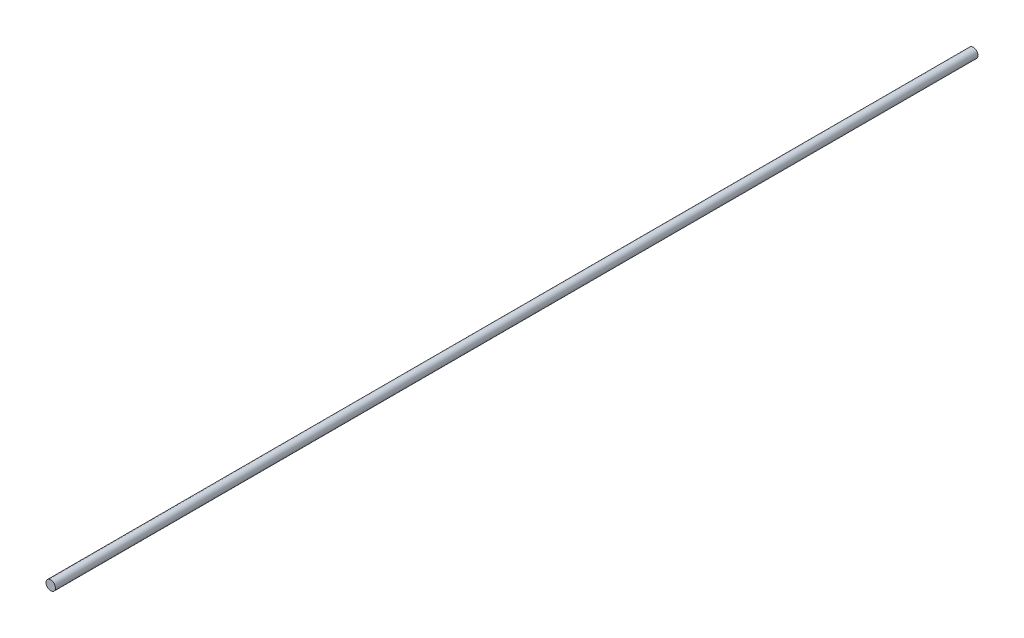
ISO-10303-21;
HEADER;
FILE_DESCRIPTION(('STEP AP214'),'2;1');
FILE_NAME('part.step','',(''),(''),'','','');
FILE_SCHEMA(('AUTOMOTIVE_DESIGN { 1 0 10303 214 1 1 1 1 }'));
ENDSEC;
DATA;
#1=APPLICATION_CONTEXT('core data for automotive mechanical design processes');
#2=APPLICATION_PROTOCOL_DEFINITION('international standard','automotive_design',2000,#1);
#3=PRODUCT_CONTEXT('',#1,'mechanical');
#4=PRODUCT('Part','Part','',(#3));
#5=PRODUCT_RELATED_PRODUCT_CATEGORY('part','',(#4));
#6=PRODUCT_DEFINITION_FORMATION('','',#4);
#7=PRODUCT_DEFINITION_CONTEXT('part definition',#1,'design');
#8=PRODUCT_DEFINITION('design','',#6,#7);
#9=PRODUCT_DEFINITION_SHAPE('','',#8);
#10=(LENGTH_UNIT() NAMED_UNIT(*) SI_UNIT(.MILLI.,.METRE.));
#11=(NAMED_UNIT(*) PLANE_ANGLE_UNIT() SI_UNIT($,.RADIAN.));
#12=(NAMED_UNIT(*) SI_UNIT($,.STERADIAN.) SOLID_ANGLE_UNIT());
#13=UNCERTAINTY_MEASURE_WITH_UNIT(LENGTH_MEASURE(1.E-05),#10,'distance_accuracy_value','');
#14=(GEOMETRIC_REPRESENTATION_CONTEXT(3) GLOBAL_UNCERTAINTY_ASSIGNED_CONTEXT((#13)) GLOBAL_UNIT_ASSIGNED_CONTEXT((#10,
#11,#12)) REPRESENTATION_CONTEXT('',''));
#15=CARTESIAN_POINT('',(0.,0.,0.));
#16=DIRECTION('',(0.,0.,1.));
#17=DIRECTION('',(1.,0.,0.));
#18=AXIS2_PLACEMENT_3D('',#15,#16,#17);
#19=CARTESIAN_POINT('',(0.,0.,-5850.));
#20=DIRECTION('',(0.,0.,1.));
#21=DIRECTION('',(1.,0.,0.));
#22=AXIS2_PLACEMENT_3D('',#19,#20,#21);
#23=CYLINDRICAL_SURFACE('',#22,30.);
#24=CARTESIAN_POINT('',(0.,0.,-5850.));
#25=DIRECTION('',(0.,0.,1.));
#26=DIRECTION('',(1.,0.,0.));
#27=AXIS2_PLACEMENT_3D('',#24,#25,#26);
#28=CIRCLE('',#27,30.);
#29=CARTESIAN_POINT('',(30.,0.,-5850.));
#30=VERTEX_POINT('',#29);
#31=EDGE_CURVE('E10',#30,#30,#28,.T.);
#32=ORIENTED_EDGE('',*,*,#31,.T.);
#33=EDGE_LOOP('',(#32));
#34=FACE_BOUND('',#33,.T.);
#35=CARTESIAN_POINT('',(0.,0.,0.));
#36=DIRECTION('',(0.,0.,1.));
#37=DIRECTION('',(1.,0.,0.));
#38=AXIS2_PLACEMENT_3D('',#35,#36,#37);
#39=CIRCLE('',#38,30.);
#40=CARTESIAN_POINT('',(30.,0.,0.));
#41=VERTEX_POINT('',#40);
#42=EDGE_CURVE('E40',#41,#41,#39,.T.);
#43=ORIENTED_EDGE('',*,*,#42,.F.);
#44=EDGE_LOOP('',(#43));
#45=FACE_BOUND('',#44,.T.);
#46=ADVANCED_FACE('F37',(#34,#45),#23,.T.);
#47=CARTESIAN_POINT('',(0.,0.,-5850.));
#48=DIRECTION('',(0.,0.,1.));
#49=DIRECTION('',(1.,0.,0.));
#50=AXIS2_PLACEMENT_3D('',#47,#48,#49);
#51=PLANE('',#50);
#52=ORIENTED_EDGE('',*,*,#31,.F.);
#53=EDGE_LOOP('',(#52));
#54=FACE_BOUND('',#53,.T.);
#55=ADVANCED_FACE('F54',(#54),#51,.F.);
#56=CARTESIAN_POINT('',(0.,0.,0.));
#57=DIRECTION('',(0.,0.,1.));
#58=DIRECTION('',(1.,0.,0.));
#59=AXIS2_PLACEMENT_3D('',#56,#57,#58);
#60=PLANE('',#59);
#61=ORIENTED_EDGE('',*,*,#42,.T.);
#62=EDGE_LOOP('',(#61));
#63=FACE_BOUND('',#62,.T.);
#64=ADVANCED_FACE('F51',(#63),#60,.T.);
#65=CLOSED_SHELL('',(#46,#55,#64));
#66=MANIFOLD_SOLID_BREP('B2',#65);
#67=ADVANCED_BREP_SHAPE_REPRESENTATION('',(#18,#66),#14);
#68=SHAPE_DEFINITION_REPRESENTATION(#9,#67);
ENDSEC;
END-ISO-10303-21;
